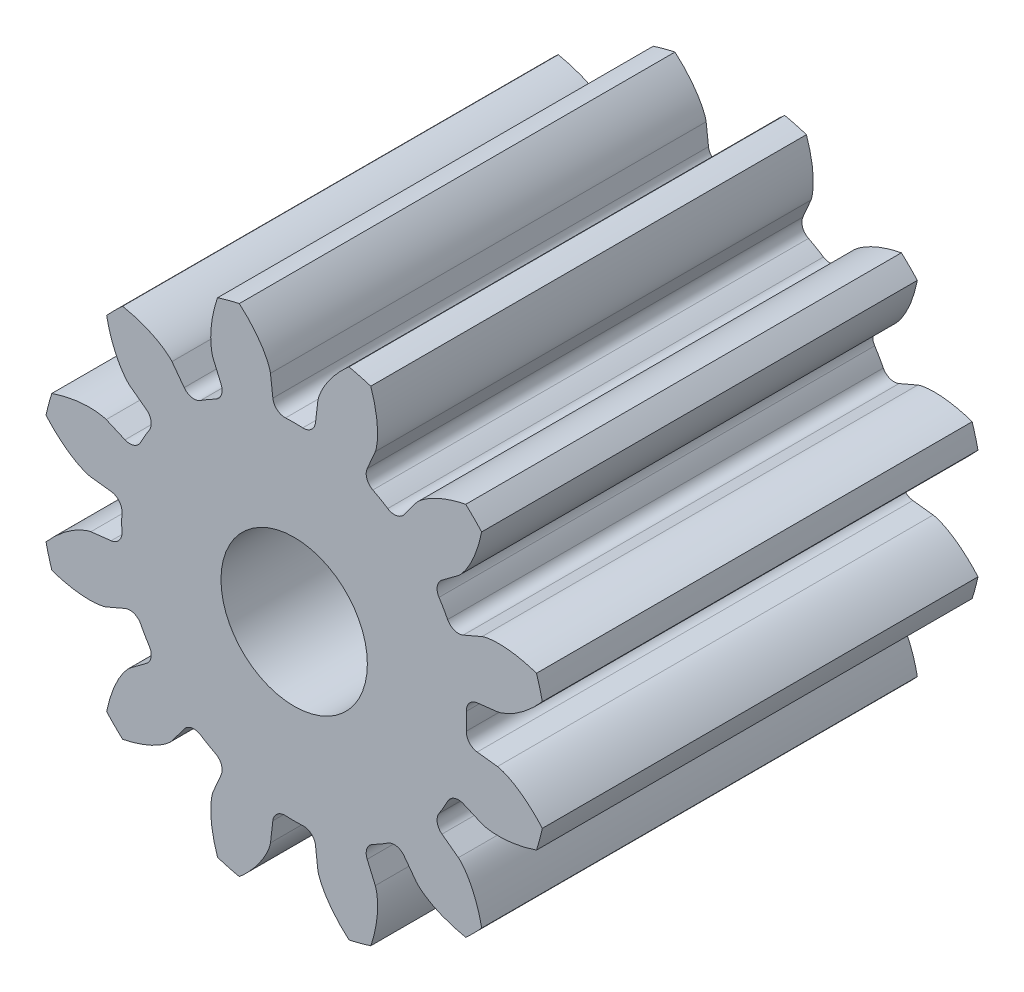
from build123d import *

# Parameters (mm, degrees)
BOSS_EXTRUDE1_DEPTH      = 6.35
BOSS_EXTRUDE1_DEPTH_BACK = 6.35
SKETCH3_R                = 7.408333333
SKETCH5_W                = 6.35
SKETCH5_H                = 2.582333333
SKETCH5_W_2              = 12.7
SKETCH5_H_2              = 2.38125
CUT_EXTRUDE1_DEPTH       = 13.251094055
FILLET1_R                = 0.355076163
CIRPATTERN1_COUNT        = 12
FILLET1_OF_CIRPATTERN1_R = 0.355076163
SKETCH6_R                = 9.160380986
CUT_EXTRUDE2_DEPTH       = 6.35
SCALE1_SCALE             = 1.5
SKETCH14_R               = 3.571875
BOSS_EXTRUDE7_DEPTH      = 9.525
SKETCH16_R               = 5.977624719
SKETCH16_R_2             = 3.2004
BOSS_EXTRUDE8_DEPTH      = 19.05


with BuildPart() as part:
    # Sketch3 → Boss-Extrude1 (new, two sides: drawn at the far end of the back side and taken through both)
    with BuildSketch(Plane.XY.offset(-BOSS_EXTRUDE1_DEPTH_BACK)):
        Circle(SKETCH3_R)
    extrude(amount=BOSS_EXTRUDE1_DEPTH + BOSS_EXTRUDE1_DEPTH_BACK)

    # Sketch5 → Cut-Revolve1 (revolve, cut)
    with BuildSketch(Plane(origin=(0, 0, 0), x_dir=(0, 0, -1), z_dir=(1, 0, 0)), mode=Mode.PRIVATE) as cut_revolve1_sk:
        with Locations((-3.175, 6.117166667)):
            Rectangle(SKETCH5_W, SKETCH5_H)
        with Locations((0, 1.190625)):
            Rectangle(SKETCH5_W_2, SKETCH5_H_2)
    revolve(cut_revolve1_sk.sketch.rotate(Axis((0, 0, 6.35), (0, 0, -1)), 90), axis=Axis((0, 0, 6.35), (0, 0, -1)), mode=Mode.SUBTRACT)

    # Sketch4 → Cut-Extrude1 (cut, symmetric)
    with BuildSketch(Plane.XY):
        with BuildLine():
            Line((4.993301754, 0.581811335), (5.926950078, 0.690598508))
            add(Edge.make_bspline(
                [(5.926950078, 0.690598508), (5.929318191, 0.690911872), (5.935944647, 0.691904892), (5.948407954, 0.694232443), (5.96863478, 0.69866684), (5.994230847, 0.70524939), (6.027084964, 0.714822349), (6.065467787, 0.727462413), (6.107282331, 0.74277265), (6.152345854, 0.760950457), (6.196898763, 0.780422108), (6.240942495, 0.801081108), (6.284441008, 0.822769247), (6.336662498, 0.8503395), (6.398612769, 0.885198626), (6.469984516, 0.92853373), (6.54965538, 0.980716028), (6.629400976, 1.037091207), (6.706647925, 1.095172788), (6.78320647, 1.156800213), (6.856219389, 1.218511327), (6.930432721, 1.285554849), (6.998115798, 1.348944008), (7.07205666, 1.423150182), (7.131183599, 1.483972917), (7.190627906, 1.549410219), (7.219315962, 1.581641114), (7.233873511, 1.598273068)],
                knots=[0, 0, 0, 0, 0, 0.005376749, 0.015083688, 0.02853182, 0.046610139, 0.064854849, 0.092110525, 0.119476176, 0.146842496, 0.174208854, 0.201574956, 0.228941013, 0.256307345, 0.307035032, 0.361767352, 0.416499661, 0.471231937, 0.525964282, 0.580696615, 0.635428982, 0.690161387, 0.744893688, 0.799626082, 0.854358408, 0.909090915, 0.909090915, 0.909090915, 0.909090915, 0.909090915], degree=4))
            ThreePointArc((7.233873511, 1.598273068), (7.408333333, 0), (7.233873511, -1.598273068))
            add(Edge.make_bspline(
                [(5.926950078, -0.690598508), (5.929318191, -0.690911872), (5.935944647, -0.691904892), (5.948407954, -0.694232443), (5.96863478, -0.69866684), (5.994230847, -0.70524939), (6.027084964, -0.714822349), (6.065467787, -0.727462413), (6.107282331, -0.74277265), (6.152345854, -0.760950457), (6.196898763, -0.780422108), (6.240942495, -0.801081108), (6.284441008, -0.822769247), (6.336662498, -0.8503395), (6.398612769, -0.885198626), (6.469984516, -0.92853373), (6.54965538, -0.980716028), (6.629400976, -1.037091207), (6.706647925, -1.095172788), (6.78320647, -1.156800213), (6.856219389, -1.218511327), (6.930432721, -1.285554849), (6.998115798, -1.348944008), (7.07205666, -1.423150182), (7.131183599, -1.483972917), (7.190627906, -1.549410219), (7.219315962, -1.581641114), (7.233873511, -1.598273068)],
                knots=[0, 0, 0, 0, 0, 0.005376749, 0.015083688, 0.02853182, 0.046610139, 0.064854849, 0.092110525, 0.119476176, 0.146842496, 0.174208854, 0.201574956, 0.228941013, 0.256307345, 0.307035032, 0.361767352, 0.416499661, 0.471231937, 0.525964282, 0.580696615, 0.635428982, 0.690161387, 0.744893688, 0.799626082, 0.854358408, 0.909090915, 0.909090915, 0.909090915, 0.909090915, 0.909090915], degree=4))
            Line((5.926950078, -0.690598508), (4.993301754, -0.581811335))
            ThreePointArc((4.993301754, -0.581811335), (5.027083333, 0), (4.993301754, 0.581811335))
        make_face()
    cut_extrude1 = extrude(amount=CUT_EXTRUDE1_DEPTH, both=True, mode=Mode.SUBTRACT)

    # Fillet1
    fillet1_edges = [part.edges().sort_by_distance(p)[0] for p in [
        (4.993301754, -0.581811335, -3.175),
        (4.993301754, 0.581811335, -3.175),
    ]]
    fillet(fillet1_edges, radius=FILLET1_R)

    # CirPattern1: Cut-Extrude1 ×12 about axis
    cirpattern1_axis = Axis((0, 0, 6.35), (0, 0, -1))
    for i in range(1, CIRPATTERN1_COUNT):
        add(cut_extrude1.rotate(cirpattern1_axis, i * 360 / CIRPATTERN1_COUNT), mode=Mode.SUBTRACT)

    # Fillet1 of CirPattern1
    fillet1_of_cirpattern1_edges = [part.edges().sort_by_distance(p)[0] for p in [
        (4.0334205, -3.000514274, -3.175),
        (4.615231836, -1.99278748, -3.175),
        (1.99278748, -4.615231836, -3.175),
        (3.000514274, -4.0334205, -3.175),
        (-0.581811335, -4.993301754, -3.175),
        (0.581811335, -4.993301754, -3.175),
        (-3.000514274, -4.0334205, -3.175),
        (-1.99278748, -4.615231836, -3.175),
        (-4.615231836, -1.99278748, -3.175),
        (-4.0334205, -3.000514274, -3.175),
        (-4.993301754, 0.581811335, -3.175),
        (-4.993301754, -0.581811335, -3.175),
        (-4.0334205, 3.000514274, -3.175),
        (-4.615231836, 1.99278748, -3.175),
        (-1.99278748, 4.615231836, -3.175),
        (-3.000514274, 4.0334205, -3.175),
        (0.581811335, 4.993301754, -3.175),
        (-0.581811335, 4.993301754, -3.175),
        (3.000514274, 4.0334205, -3.175),
        (1.99278748, 4.615231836, -3.175),
        (4.615231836, 1.99278748, -3.175),
        (4.0334205, 3.000514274, -3.175),
    ]]
    fillet(fillet1_of_cirpattern1_edges, radius=FILLET1_OF_CIRPATTERN1_R)

    # Sketch6 → Cut-Extrude2 (cut)
    with BuildSketch(Plane.XY.offset(6.35)):
        Circle(SKETCH6_R)
    extrude(amount=-CUT_EXTRUDE2_DEPTH, mode=Mode.SUBTRACT)


with BuildPart() as part_1:
    # Scale1: scaled about (-1e-08, 0, -3.174999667)
    add(part.part.scale(SCALE1_SCALE).moved(Location((5e-09, 0, 1.587499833))))


with BuildPart() as boss_extrude7_tool:
    # Sketch14 → Boss-Extrude7 (new body)
    with BuildSketch(Plane(origin=(0, 0, -7.937501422), x_dir=(-1, 0, 0), z_dir=(0, 0, -1))):
        with BuildLine():
            Line((-5.342326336, -7.181385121), (-4.808174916, -6.46335578))
            ThreePointArc((-4.808174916, -6.46335578), (-4.475570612, -6.2571353), (-4.091822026, -6.333878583))
            ThreePointArc((-4.091822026, -6.333878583), (-3.7703125, -6.53037281), (-3.439388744, -6.710561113))
            ThreePointArc((-3.439388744, -6.710561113), (-3.181052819, -7.004525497), (-3.193342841, -7.395679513))
            Line((-3.193342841, -7.395679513), (-3.548098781, -8.217282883))
            add(Edge.make_bspline(
                [(-3.548098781, -8.217282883), (-3.549467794, -8.220594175), (-3.553147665, -8.229946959), (-3.559471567, -8.247882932), (-3.568881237, -8.277484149), (-3.579527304, -8.315671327), (-3.591732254, -8.365529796), (-3.604099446, -8.424870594), (-3.615571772, -8.490671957), (-3.62575575, -8.562844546), (-3.633876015, -8.635324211), (-3.640071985, -8.708032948), (-3.644522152, -8.780805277), (-3.64787346, -8.869320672), (-3.649052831, -8.97594078), (-3.64628769, -9.101156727), (-3.638254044, -9.243788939), (-3.624829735, -9.38966289), (-3.60731476, -9.533570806), (-3.584677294, -9.679243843), (-3.559271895, -9.820373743), (-3.527839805, -9.96706233), (-3.496257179, -10.102527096), (-3.455316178, -10.254233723), (-3.420650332, -10.376658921), (-3.380228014, -10.502957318), (-3.359874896, -10.564397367), (-3.349187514, -10.595782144)],
                knots=[0, 0, 0, 0, 0, 0.005376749, 0.015083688, 0.02853182, 0.046610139, 0.064854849, 0.092110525, 0.119476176, 0.146842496, 0.174208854, 0.201574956, 0.228941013, 0.256307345, 0.307035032, 0.361767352, 0.416499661, 0.471231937, 0.525964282, 0.580696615, 0.635428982, 0.690161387, 0.744893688, 0.799626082, 0.854358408, 0.909090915, 0.909090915, 0.909090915, 0.909090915, 0.909090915], degree=4))
            ThreePointArc((-3.349187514, -10.595782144), (-2.876126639, -10.733850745), (-2.397409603, -10.850810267))
            add(Edge.make_bspline(
                [(-2.397409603, -10.850810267), (-2.37246167, -10.828973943), (-2.324115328, -10.785941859), (-2.225959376, -10.696775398), (-2.134725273, -10.608084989), (-2.023416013, -10.497173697), (-1.928332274, -10.395649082), (-1.827766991, -10.284329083), (-1.73520032, -10.174809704), (-1.642759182, -10.059971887), (-1.555636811, -9.944101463), (-1.471074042, -9.824483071), (-1.392800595, -9.704976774), (-1.327797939, -9.597919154), (-1.27550925, -9.504993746), (-1.23415387, -9.426661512), (-1.201621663, -9.361413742), (-1.170633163, -9.295348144), (-1.141425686, -9.22851878), (-1.114158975, -9.160923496), (-1.091193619, -9.098201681), (-1.072233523, -9.040627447), (-1.057874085, -8.991346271), (-1.04800026, -8.952952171), (-1.041348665, -8.92261193), (-1.037857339, -8.903916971), (-1.036367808, -8.893977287), (-1.035897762, -8.890425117)],
                knots=[0, 0, 0, 0, 0, 0.054732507, 0.109464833, 0.164197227, 0.218929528, 0.273661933, 0.328394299, 0.383126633, 0.437858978, 0.492591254, 0.547323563, 0.602055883, 0.65278357, 0.680149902, 0.707515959, 0.734882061, 0.762248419, 0.789614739, 0.81698039, 0.844236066, 0.862480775, 0.880559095, 0.894007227, 0.903714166, 0.909090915, 0.909090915, 0.909090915, 0.909090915, 0.909090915], degree=4))
            Line((-1.035897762, -8.890425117), (-0.932323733, -8.001517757))
            ThreePointArc((-0.932323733, -8.001517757), (-0.747390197, -7.656623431), (-0.376682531, -7.53121077))
            ThreePointArc((-0.376682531, -7.53121077), (0, -7.540625), (0.376682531, -7.53121077))
            ThreePointArc((0.376682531, -7.53121077), (0.747390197, -7.656623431), (0.932323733, -8.001517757))
            Line((0.932323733, -8.001517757), (1.035897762, -8.890425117))
            add(Edge.make_bspline(
                [(1.035897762, -8.890425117), (1.036367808, -8.893977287), (1.037857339, -8.903916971), (1.041348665, -8.92261193), (1.04800026, -8.952952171), (1.057874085, -8.991346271), (1.072233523, -9.040627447), (1.091193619, -9.098201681), (1.114158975, -9.160923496), (1.141425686, -9.22851878), (1.170633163, -9.295348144), (1.201621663, -9.361413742), (1.23415387, -9.426661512), (1.27550925, -9.504993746), (1.327797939, -9.597919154), (1.392800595, -9.704976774), (1.471074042, -9.824483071), (1.555636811, -9.944101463), (1.642759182, -10.059971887), (1.73520032, -10.174809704), (1.827766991, -10.284329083), (1.928332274, -10.395649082), (2.023416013, -10.497173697), (2.134725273, -10.608084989), (2.225959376, -10.696775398), (2.324115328, -10.785941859), (2.37246167, -10.828973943), (2.397409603, -10.850810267)],
                knots=[0, 0, 0, 0, 0, 0.005376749, 0.015083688, 0.02853182, 0.046610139, 0.064854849, 0.092110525, 0.119476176, 0.146842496, 0.174208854, 0.201574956, 0.228941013, 0.256307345, 0.307035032, 0.361767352, 0.416499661, 0.471231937, 0.525964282, 0.580696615, 0.635428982, 0.690161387, 0.744893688, 0.799626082, 0.854358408, 0.909090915, 0.909090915, 0.909090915, 0.909090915, 0.909090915], degree=4))
            ThreePointArc((2.397409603, -10.850810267), (2.876126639, -10.733850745), (3.349187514, -10.595782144))
            add(Edge.make_bspline(
                [(3.349187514, -10.595782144), (3.359874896, -10.564397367), (3.380228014, -10.502957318), (3.420650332, -10.376658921), (3.455316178, -10.254233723), (3.496257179, -10.102527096), (3.527839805, -9.96706233), (3.559271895, -9.820373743), (3.584677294, -9.679243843), (3.60731476, -9.533570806), (3.624829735, -9.38966289), (3.638254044, -9.243788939), (3.64628769, -9.101156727), (3.649052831, -8.97594078), (3.64787346, -8.869320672), (3.644522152, -8.780805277), (3.640071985, -8.708032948), (3.633876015, -8.635324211), (3.62575575, -8.562844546), (3.615571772, -8.490671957), (3.604099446, -8.424870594), (3.591732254, -8.365529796), (3.579527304, -8.315671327), (3.568881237, -8.277484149), (3.559471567, -8.247882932), (3.553147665, -8.229946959), (3.549467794, -8.220594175), (3.548098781, -8.217282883)],
                knots=[0, 0, 0, 0, 0, 0.054732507, 0.109464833, 0.164197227, 0.218929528, 0.273661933, 0.328394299, 0.383126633, 0.437858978, 0.492591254, 0.547323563, 0.602055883, 0.65278357, 0.680149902, 0.707515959, 0.734882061, 0.762248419, 0.789614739, 0.81698039, 0.844236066, 0.862480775, 0.880559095, 0.894007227, 0.903714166, 0.909090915, 0.909090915, 0.909090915, 0.909090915, 0.909090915], degree=4))
            Line((3.548098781, -8.217282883), (3.193342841, -7.395679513))
            ThreePointArc((3.193342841, -7.395679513), (3.181052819, -7.004525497), (3.439388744, -6.710561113))
            ThreePointArc((3.439388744, -6.710561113), (3.7703125, -6.53037281), (4.091822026, -6.333878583))
            ThreePointArc((4.091822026, -6.333878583), (4.475570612, -6.2571353), (4.808174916, -6.46335578))
            Line((4.808174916, -6.46335578), (5.342326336, -7.181385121))
            add(Edge.make_bspline(
                [(5.342326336, -7.181385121), (5.344509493, -7.184226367), (5.350769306, -7.192089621), (5.363140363, -7.206534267), (5.384070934, -7.229483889), (5.411818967, -7.257797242), (5.448895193, -7.293296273), (5.494102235, -7.333676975), (5.545351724, -7.376512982), (5.602763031, -7.42141886), (5.661472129, -7.464691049), (5.721341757, -7.506411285), (5.782139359, -7.546651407), (5.857120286, -7.593811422), (5.948866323, -7.648142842), (6.058689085, -7.708356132), (6.186229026, -7.772714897), (6.319271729, -7.83402608), (6.452657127, -7.890811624), (6.59013241, -7.944043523), (6.725057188, -7.992606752), (6.867809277, -8.038730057), (7.000916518, -8.079111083), (7.152768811, -8.11950845), (7.276125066, -8.150699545), (7.405713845, -8.17884199), (7.469099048, -8.191935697), (7.501622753, -8.198372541)],
                knots=[0, 0, 0, 0, 0, 0.005376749, 0.015083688, 0.02853182, 0.046610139, 0.064854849, 0.092110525, 0.119476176, 0.146842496, 0.174208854, 0.201574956, 0.228941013, 0.256307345, 0.307035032, 0.361767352, 0.416499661, 0.471231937, 0.525964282, 0.580696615, 0.635428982, 0.690161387, 0.744893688, 0.799626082, 0.854358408, 0.909090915, 0.909090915, 0.909090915, 0.909090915, 0.909090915], degree=4))
            ThreePointArc((7.501622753, -8.198372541), (7.857724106, -7.857724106), (8.198372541, -7.501622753))
            add(Edge.make_bspline(
                [(8.198372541, -7.501622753), (8.191935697, -7.469099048), (8.17884199, -7.405713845), (8.150699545, -7.276125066), (8.11950845, -7.152768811), (8.079111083, -7.000916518), (8.038730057, -6.867809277), (7.992606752, -6.725057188), (7.944043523, -6.59013241), (7.890811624, -6.452657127), (7.83402608, -6.319271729), (7.772714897, -6.186229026), (7.708356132, -6.058689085), (7.648142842, -5.948866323), (7.593811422, -5.857120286), (7.546651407, -5.782139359), (7.506411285, -5.721341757), (7.464691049, -5.661472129), (7.42141886, -5.602763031), (7.376512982, -5.545351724), (7.333676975, -5.494102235), (7.293296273, -5.448895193), (7.257797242, -5.411818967), (7.229483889, -5.384070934), (7.206534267, -5.363140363), (7.192089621, -5.350769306), (7.184226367, -5.344509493), (7.181385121, -5.342326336)],
                knots=[0, 0, 0, 0, 0, 0.054732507, 0.109464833, 0.164197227, 0.218929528, 0.273661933, 0.328394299, 0.383126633, 0.437858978, 0.492591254, 0.547323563, 0.602055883, 0.65278357, 0.680149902, 0.707515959, 0.734882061, 0.762248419, 0.789614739, 0.81698039, 0.844236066, 0.862480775, 0.880559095, 0.894007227, 0.903714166, 0.909090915, 0.909090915, 0.909090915, 0.909090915, 0.909090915], degree=4))
            Line((7.181385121, -5.342326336), (6.46335578, -4.808174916))
            ThreePointArc((6.46335578, -4.808174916), (6.2571353, -4.475570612), (6.333878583, -4.091822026))
            ThreePointArc((6.333878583, -4.091822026), (6.53037281, -3.7703125), (6.710561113, -3.439388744))
            ThreePointArc((6.710561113, -3.439388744), (7.004525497, -3.181052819), (7.395679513, -3.193342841))
            Line((7.395679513, -3.193342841), (8.217282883, -3.548098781))
            add(Edge.make_bspline(
                [(8.217282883, -3.548098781), (8.220594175, -3.549467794), (8.229946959, -3.553147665), (8.247882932, -3.559471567), (8.277484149, -3.568881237), (8.315671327, -3.579527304), (8.365529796, -3.591732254), (8.424870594, -3.604099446), (8.490671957, -3.615571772), (8.562844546, -3.62575575), (8.635324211, -3.633876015), (8.708032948, -3.640071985), (8.780805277, -3.644522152), (8.869320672, -3.64787346), (8.97594078, -3.649052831), (9.101156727, -3.64628769), (9.243788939, -3.638254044), (9.38966289, -3.624829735), (9.533570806, -3.60731476), (9.679243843, -3.584677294), (9.820373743, -3.559271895), (9.96706233, -3.527839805), (10.102527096, -3.496257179), (10.254233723, -3.455316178), (10.376658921, -3.420650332), (10.502957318, -3.380228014), (10.564397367, -3.359874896), (10.595782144, -3.349187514)],
                knots=[0, 0, 0, 0, 0, 0.005376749, 0.015083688, 0.02853182, 0.046610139, 0.064854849, 0.092110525, 0.119476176, 0.146842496, 0.174208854, 0.201574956, 0.228941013, 0.256307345, 0.307035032, 0.361767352, 0.416499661, 0.471231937, 0.525964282, 0.580696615, 0.635428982, 0.690161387, 0.744893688, 0.799626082, 0.854358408, 0.909090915, 0.909090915, 0.909090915, 0.909090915, 0.909090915], degree=4))
            ThreePointArc((10.595782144, -3.349187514), (10.733850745, -2.876126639), (10.850810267, -2.397409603))
            add(Edge.make_bspline(
                [(10.850810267, -2.397409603), (10.828973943, -2.37246167), (10.785941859, -2.324115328), (10.696775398, -2.225959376), (10.608084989, -2.134725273), (10.497173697, -2.023416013), (10.395649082, -1.928332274), (10.284329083, -1.827766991), (10.174809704, -1.73520032), (10.059971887, -1.642759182), (9.944101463, -1.555636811), (9.824483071, -1.471074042), (9.704976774, -1.392800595), (9.597919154, -1.327797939), (9.504993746, -1.27550925), (9.426661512, -1.23415387), (9.361413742, -1.201621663), (9.295348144, -1.170633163), (9.22851878, -1.141425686), (9.160923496, -1.114158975), (9.098201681, -1.091193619), (9.040627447, -1.072233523), (8.991346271, -1.057874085), (8.952952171, -1.04800026), (8.92261193, -1.041348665), (8.903916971, -1.037857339), (8.893977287, -1.036367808), (8.890425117, -1.035897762)],
                knots=[0, 0, 0, 0, 0, 0.054732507, 0.109464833, 0.164197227, 0.218929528, 0.273661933, 0.328394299, 0.383126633, 0.437858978, 0.492591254, 0.547323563, 0.602055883, 0.65278357, 0.680149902, 0.707515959, 0.734882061, 0.762248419, 0.789614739, 0.81698039, 0.844236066, 0.862480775, 0.880559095, 0.894007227, 0.903714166, 0.909090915, 0.909090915, 0.909090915, 0.909090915, 0.909090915], degree=4))
            Line((8.890425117, -1.035897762), (8.001517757, -0.932323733))
            ThreePointArc((8.001517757, -0.932323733), (7.656623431, -0.747390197), (7.53121077, -0.376682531))
            ThreePointArc((7.53121077, -0.376682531), (7.540625, 0), (7.53121077, 0.376682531))
            ThreePointArc((7.53121077, 0.376682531), (7.656623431, 0.747390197), (8.001517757, 0.932323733))
            Line((8.001517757, 0.932323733), (8.890425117, 1.035897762))
            add(Edge.make_bspline(
                [(8.890425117, 1.035897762), (8.893977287, 1.036367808), (8.903916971, 1.037857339), (8.92261193, 1.041348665), (8.952952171, 1.04800026), (8.991346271, 1.057874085), (9.040627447, 1.072233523), (9.098201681, 1.091193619), (9.160923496, 1.114158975), (9.22851878, 1.141425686), (9.295348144, 1.170633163), (9.361413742, 1.201621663), (9.426661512, 1.23415387), (9.504993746, 1.27550925), (9.597919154, 1.327797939), (9.704976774, 1.392800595), (9.824483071, 1.471074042), (9.944101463, 1.555636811), (10.059971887, 1.642759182), (10.174809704, 1.73520032), (10.284329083, 1.827766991), (10.395649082, 1.928332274), (10.497173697, 2.023416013), (10.608084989, 2.134725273), (10.696775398, 2.225959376), (10.785941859, 2.324115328), (10.828973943, 2.37246167), (10.850810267, 2.397409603)],
                knots=[0, 0, 0, 0, 0, 0.005376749, 0.015083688, 0.02853182, 0.046610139, 0.064854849, 0.092110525, 0.119476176, 0.146842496, 0.174208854, 0.201574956, 0.228941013, 0.256307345, 0.307035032, 0.361767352, 0.416499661, 0.471231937, 0.525964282, 0.580696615, 0.635428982, 0.690161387, 0.744893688, 0.799626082, 0.854358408, 0.909090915, 0.909090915, 0.909090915, 0.909090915, 0.909090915], degree=4))
            ThreePointArc((10.850810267, 2.397409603), (10.733850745, 2.876126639), (10.595782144, 3.349187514))
            add(Edge.make_bspline(
                [(10.595782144, 3.349187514), (10.564397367, 3.359874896), (10.502957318, 3.380228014), (10.376658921, 3.420650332), (10.254233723, 3.455316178), (10.102527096, 3.496257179), (9.96706233, 3.527839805), (9.820373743, 3.559271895), (9.679243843, 3.584677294), (9.533570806, 3.60731476), (9.38966289, 3.624829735), (9.243788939, 3.638254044), (9.101156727, 3.64628769), (8.97594078, 3.649052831), (8.869320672, 3.64787346), (8.780805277, 3.644522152), (8.708032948, 3.640071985), (8.635324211, 3.633876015), (8.562844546, 3.62575575), (8.490671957, 3.615571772), (8.424870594, 3.604099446), (8.365529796, 3.591732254), (8.315671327, 3.579527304), (8.277484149, 3.568881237), (8.247882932, 3.559471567), (8.229946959, 3.553147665), (8.220594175, 3.549467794), (8.217282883, 3.548098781)],
                knots=[0, 0, 0, 0, 0, 0.054732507, 0.109464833, 0.164197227, 0.218929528, 0.273661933, 0.328394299, 0.383126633, 0.437858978, 0.492591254, 0.547323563, 0.602055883, 0.65278357, 0.680149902, 0.707515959, 0.734882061, 0.762248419, 0.789614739, 0.81698039, 0.844236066, 0.862480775, 0.880559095, 0.894007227, 0.903714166, 0.909090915, 0.909090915, 0.909090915, 0.909090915, 0.909090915], degree=4))
            Line((8.217282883, 3.548098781), (7.395679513, 3.193342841))
            ThreePointArc((7.395679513, 3.193342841), (7.004525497, 3.181052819), (6.710561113, 3.439388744))
            ThreePointArc((6.710561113, 3.439388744), (6.53037281, 3.7703125), (6.333878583, 4.091822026))
            ThreePointArc((6.333878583, 4.091822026), (6.2571353, 4.475570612), (6.46335578, 4.808174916))
            Line((6.46335578, 4.808174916), (7.181385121, 5.342326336))
            add(Edge.make_bspline(
                [(7.181385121, 5.342326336), (7.184226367, 5.344509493), (7.192089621, 5.350769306), (7.206534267, 5.363140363), (7.229483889, 5.384070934), (7.257797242, 5.411818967), (7.293296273, 5.448895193), (7.333676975, 5.494102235), (7.376512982, 5.545351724), (7.42141886, 5.602763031), (7.464691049, 5.661472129), (7.506411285, 5.721341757), (7.546651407, 5.782139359), (7.593811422, 5.857120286), (7.648142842, 5.948866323), (7.708356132, 6.058689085), (7.772714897, 6.186229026), (7.83402608, 6.319271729), (7.890811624, 6.452657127), (7.944043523, 6.59013241), (7.992606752, 6.725057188), (8.038730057, 6.867809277), (8.079111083, 7.000916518), (8.11950845, 7.152768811), (8.150699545, 7.276125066), (8.17884199, 7.405713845), (8.191935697, 7.469099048), (8.198372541, 7.501622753)],
                knots=[0, 0, 0, 0, 0, 0.005376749, 0.015083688, 0.02853182, 0.046610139, 0.064854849, 0.092110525, 0.119476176, 0.146842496, 0.174208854, 0.201574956, 0.228941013, 0.256307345, 0.307035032, 0.361767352, 0.416499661, 0.471231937, 0.525964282, 0.580696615, 0.635428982, 0.690161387, 0.744893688, 0.799626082, 0.854358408, 0.909090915, 0.909090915, 0.909090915, 0.909090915, 0.909090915], degree=4))
            ThreePointArc((8.198372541, 7.501622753), (7.857724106, 7.857724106), (7.501622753, 8.198372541))
            add(Edge.make_bspline(
                [(7.501622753, 8.198372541), (7.469099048, 8.191935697), (7.405713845, 8.17884199), (7.276125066, 8.150699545), (7.152768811, 8.11950845), (7.000916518, 8.079111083), (6.867809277, 8.038730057), (6.725057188, 7.992606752), (6.59013241, 7.944043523), (6.452657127, 7.890811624), (6.319271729, 7.83402608), (6.186229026, 7.772714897), (6.058689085, 7.708356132), (5.948866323, 7.648142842), (5.857120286, 7.593811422), (5.782139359, 7.546651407), (5.721341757, 7.506411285), (5.661472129, 7.464691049), (5.602763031, 7.42141886), (5.545351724, 7.376512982), (5.494102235, 7.333676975), (5.448895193, 7.293296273), (5.411818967, 7.257797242), (5.384070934, 7.229483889), (5.363140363, 7.206534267), (5.350769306, 7.192089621), (5.344509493, 7.184226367), (5.342326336, 7.181385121)],
                knots=[0, 0, 0, 0, 0, 0.054732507, 0.109464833, 0.164197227, 0.218929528, 0.273661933, 0.328394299, 0.383126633, 0.437858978, 0.492591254, 0.547323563, 0.602055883, 0.65278357, 0.680149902, 0.707515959, 0.734882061, 0.762248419, 0.789614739, 0.81698039, 0.844236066, 0.862480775, 0.880559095, 0.894007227, 0.903714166, 0.909090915, 0.909090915, 0.909090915, 0.909090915, 0.909090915], degree=4))
            Line((5.342326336, 7.181385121), (4.808174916, 6.46335578))
            ThreePointArc((4.808174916, 6.46335578), (4.475570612, 6.2571353), (4.091822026, 6.333878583))
            ThreePointArc((4.091822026, 6.333878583), (3.7703125, 6.53037281), (3.439388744, 6.710561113))
            ThreePointArc((3.439388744, 6.710561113), (3.181052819, 7.004525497), (3.193342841, 7.395679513))
            Line((3.193342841, 7.395679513), (3.548098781, 8.217282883))
            add(Edge.make_bspline(
                [(3.548098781, 8.217282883), (3.549467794, 8.220594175), (3.553147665, 8.229946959), (3.559471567, 8.247882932), (3.568881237, 8.277484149), (3.579527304, 8.315671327), (3.591732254, 8.365529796), (3.604099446, 8.424870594), (3.615571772, 8.490671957), (3.62575575, 8.562844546), (3.633876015, 8.635324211), (3.640071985, 8.708032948), (3.644522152, 8.780805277), (3.64787346, 8.869320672), (3.649052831, 8.97594078), (3.64628769, 9.101156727), (3.638254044, 9.243788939), (3.624829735, 9.38966289), (3.60731476, 9.533570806), (3.584677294, 9.679243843), (3.559271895, 9.820373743), (3.527839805, 9.96706233), (3.496257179, 10.102527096), (3.455316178, 10.254233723), (3.420650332, 10.376658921), (3.380228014, 10.502957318), (3.359874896, 10.564397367), (3.349187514, 10.595782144)],
                knots=[0, 0, 0, 0, 0, 0.005376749, 0.015083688, 0.02853182, 0.046610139, 0.064854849, 0.092110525, 0.119476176, 0.146842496, 0.174208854, 0.201574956, 0.228941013, 0.256307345, 0.307035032, 0.361767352, 0.416499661, 0.471231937, 0.525964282, 0.580696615, 0.635428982, 0.690161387, 0.744893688, 0.799626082, 0.854358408, 0.909090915, 0.909090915, 0.909090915, 0.909090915, 0.909090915], degree=4))
            ThreePointArc((3.349187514, 10.595782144), (2.876126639, 10.733850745), (2.397409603, 10.850810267))
            add(Edge.make_bspline(
                [(2.397409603, 10.850810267), (2.37246167, 10.828973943), (2.324115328, 10.785941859), (2.225959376, 10.696775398), (2.134725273, 10.608084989), (2.023416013, 10.497173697), (1.928332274, 10.395649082), (1.827766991, 10.284329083), (1.73520032, 10.174809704), (1.642759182, 10.059971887), (1.555636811, 9.944101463), (1.471074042, 9.824483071), (1.392800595, 9.704976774), (1.327797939, 9.597919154), (1.27550925, 9.504993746), (1.23415387, 9.426661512), (1.201621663, 9.361413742), (1.170633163, 9.295348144), (1.141425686, 9.22851878), (1.114158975, 9.160923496), (1.091193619, 9.098201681), (1.072233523, 9.040627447), (1.057874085, 8.991346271), (1.04800026, 8.952952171), (1.041348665, 8.92261193), (1.037857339, 8.903916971), (1.036367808, 8.893977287), (1.035897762, 8.890425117)],
                knots=[0, 0, 0, 0, 0, 0.054732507, 0.109464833, 0.164197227, 0.218929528, 0.273661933, 0.328394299, 0.383126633, 0.437858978, 0.492591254, 0.547323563, 0.602055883, 0.65278357, 0.680149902, 0.707515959, 0.734882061, 0.762248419, 0.789614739, 0.81698039, 0.844236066, 0.862480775, 0.880559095, 0.894007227, 0.903714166, 0.909090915, 0.909090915, 0.909090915, 0.909090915, 0.909090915], degree=4))
            Line((1.035897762, 8.890425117), (0.932323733, 8.001517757))
            ThreePointArc((0.932323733, 8.001517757), (0.747390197, 7.656623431), (0.376682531, 7.53121077))
            ThreePointArc((0.376682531, 7.53121077), (0, 7.540625), (-0.376682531, 7.53121077))
            ThreePointArc((-0.376682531, 7.53121077), (-0.747390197, 7.656623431), (-0.932323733, 8.001517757))
            Line((-0.932323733, 8.001517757), (-1.035897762, 8.890425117))
            add(Edge.make_bspline(
                [(-1.035897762, 8.890425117), (-1.036367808, 8.893977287), (-1.037857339, 8.903916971), (-1.041348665, 8.92261193), (-1.04800026, 8.952952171), (-1.057874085, 8.991346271), (-1.072233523, 9.040627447), (-1.091193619, 9.098201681), (-1.114158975, 9.160923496), (-1.141425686, 9.22851878), (-1.170633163, 9.295348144), (-1.201621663, 9.361413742), (-1.23415387, 9.426661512), (-1.27550925, 9.504993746), (-1.327797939, 9.597919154), (-1.392800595, 9.704976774), (-1.471074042, 9.824483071), (-1.555636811, 9.944101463), (-1.642759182, 10.059971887), (-1.73520032, 10.174809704), (-1.827766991, 10.284329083), (-1.928332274, 10.395649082), (-2.023416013, 10.497173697), (-2.134725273, 10.608084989), (-2.225959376, 10.696775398), (-2.324115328, 10.785941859), (-2.37246167, 10.828973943), (-2.397409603, 10.850810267)],
                knots=[0, 0, 0, 0, 0, 0.005376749, 0.015083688, 0.02853182, 0.046610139, 0.064854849, 0.092110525, 0.119476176, 0.146842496, 0.174208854, 0.201574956, 0.228941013, 0.256307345, 0.307035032, 0.361767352, 0.416499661, 0.471231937, 0.525964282, 0.580696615, 0.635428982, 0.690161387, 0.744893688, 0.799626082, 0.854358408, 0.909090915, 0.909090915, 0.909090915, 0.909090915, 0.909090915], degree=4))
            ThreePointArc((-2.397409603, 10.850810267), (-2.876126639, 10.733850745), (-3.349187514, 10.595782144))
            add(Edge.make_bspline(
                [(-3.349187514, 10.595782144), (-3.359874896, 10.564397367), (-3.380228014, 10.502957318), (-3.420650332, 10.376658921), (-3.455316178, 10.254233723), (-3.496257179, 10.102527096), (-3.527839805, 9.96706233), (-3.559271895, 9.820373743), (-3.584677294, 9.679243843), (-3.60731476, 9.533570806), (-3.624829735, 9.38966289), (-3.638254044, 9.243788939), (-3.64628769, 9.101156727), (-3.649052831, 8.97594078), (-3.64787346, 8.869320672), (-3.644522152, 8.780805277), (-3.640071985, 8.708032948), (-3.633876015, 8.635324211), (-3.62575575, 8.562844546), (-3.615571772, 8.490671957), (-3.604099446, 8.424870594), (-3.591732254, 8.365529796), (-3.579527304, 8.315671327), (-3.568881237, 8.277484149), (-3.559471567, 8.247882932), (-3.553147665, 8.229946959), (-3.549467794, 8.220594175), (-3.548098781, 8.217282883)],
                knots=[0, 0, 0, 0, 0, 0.054732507, 0.109464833, 0.164197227, 0.218929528, 0.273661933, 0.328394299, 0.383126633, 0.437858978, 0.492591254, 0.547323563, 0.602055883, 0.65278357, 0.680149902, 0.707515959, 0.734882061, 0.762248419, 0.789614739, 0.81698039, 0.844236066, 0.862480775, 0.880559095, 0.894007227, 0.903714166, 0.909090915, 0.909090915, 0.909090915, 0.909090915, 0.909090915], degree=4))
            Line((-3.548098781, 8.217282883), (-3.193342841, 7.395679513))
            ThreePointArc((-3.193342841, 7.395679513), (-3.181052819, 7.004525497), (-3.439388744, 6.710561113))
            ThreePointArc((-3.439388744, 6.710561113), (-3.7703125, 6.53037281), (-4.091822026, 6.333878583))
            ThreePointArc((-4.091822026, 6.333878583), (-4.475570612, 6.2571353), (-4.808174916, 6.46335578))
            Line((-4.808174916, 6.46335578), (-5.342326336, 7.181385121))
            add(Edge.make_bspline(
                [(-5.342326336, 7.181385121), (-5.344509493, 7.184226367), (-5.350769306, 7.192089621), (-5.363140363, 7.206534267), (-5.384070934, 7.229483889), (-5.411818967, 7.257797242), (-5.448895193, 7.293296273), (-5.494102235, 7.333676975), (-5.545351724, 7.376512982), (-5.602763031, 7.42141886), (-5.661472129, 7.464691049), (-5.721341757, 7.506411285), (-5.782139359, 7.546651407), (-5.857120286, 7.593811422), (-5.948866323, 7.648142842), (-6.058689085, 7.708356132), (-6.186229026, 7.772714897), (-6.319271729, 7.83402608), (-6.452657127, 7.890811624), (-6.59013241, 7.944043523), (-6.725057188, 7.992606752), (-6.867809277, 8.038730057), (-7.000916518, 8.079111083), (-7.152768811, 8.11950845), (-7.276125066, 8.150699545), (-7.405713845, 8.17884199), (-7.469099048, 8.191935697), (-7.501622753, 8.198372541)],
                knots=[0, 0, 0, 0, 0, 0.005376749, 0.015083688, 0.02853182, 0.046610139, 0.064854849, 0.092110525, 0.119476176, 0.146842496, 0.174208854, 0.201574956, 0.228941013, 0.256307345, 0.307035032, 0.361767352, 0.416499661, 0.471231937, 0.525964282, 0.580696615, 0.635428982, 0.690161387, 0.744893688, 0.799626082, 0.854358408, 0.909090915, 0.909090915, 0.909090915, 0.909090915, 0.909090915], degree=4))
            ThreePointArc((-7.501622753, 8.198372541), (-7.857724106, 7.857724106), (-8.198372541, 7.501622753))
            add(Edge.make_bspline(
                [(-8.198372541, 7.501622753), (-8.191935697, 7.469099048), (-8.17884199, 7.405713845), (-8.150699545, 7.276125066), (-8.11950845, 7.152768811), (-8.079111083, 7.000916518), (-8.038730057, 6.867809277), (-7.992606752, 6.725057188), (-7.944043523, 6.59013241), (-7.890811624, 6.452657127), (-7.83402608, 6.319271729), (-7.772714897, 6.186229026), (-7.708356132, 6.058689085), (-7.648142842, 5.948866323), (-7.593811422, 5.857120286), (-7.546651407, 5.782139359), (-7.506411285, 5.721341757), (-7.464691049, 5.661472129), (-7.42141886, 5.602763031), (-7.376512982, 5.545351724), (-7.333676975, 5.494102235), (-7.293296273, 5.448895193), (-7.257797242, 5.411818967), (-7.229483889, 5.384070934), (-7.206534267, 5.363140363), (-7.192089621, 5.350769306), (-7.184226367, 5.344509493), (-7.181385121, 5.342326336)],
                knots=[0, 0, 0, 0, 0, 0.054732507, 0.109464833, 0.164197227, 0.218929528, 0.273661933, 0.328394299, 0.383126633, 0.437858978, 0.492591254, 0.547323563, 0.602055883, 0.65278357, 0.680149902, 0.707515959, 0.734882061, 0.762248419, 0.789614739, 0.81698039, 0.844236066, 0.862480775, 0.880559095, 0.894007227, 0.903714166, 0.909090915, 0.909090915, 0.909090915, 0.909090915, 0.909090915], degree=4))
            Line((-7.181385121, 5.342326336), (-6.46335578, 4.808174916))
            ThreePointArc((-6.46335578, 4.808174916), (-6.2571353, 4.475570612), (-6.333878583, 4.091822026))
            ThreePointArc((-6.333878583, 4.091822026), (-6.53037281, 3.7703125), (-6.710561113, 3.439388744))
            ThreePointArc((-6.710561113, 3.439388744), (-7.004525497, 3.181052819), (-7.395679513, 3.193342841))
            Line((-7.395679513, 3.193342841), (-8.217282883, 3.548098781))
            add(Edge.make_bspline(
                [(-8.217282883, 3.548098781), (-8.220594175, 3.549467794), (-8.229946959, 3.553147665), (-8.247882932, 3.559471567), (-8.277484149, 3.568881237), (-8.315671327, 3.579527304), (-8.365529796, 3.591732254), (-8.424870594, 3.604099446), (-8.490671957, 3.615571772), (-8.562844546, 3.62575575), (-8.635324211, 3.633876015), (-8.708032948, 3.640071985), (-8.780805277, 3.644522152), (-8.869320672, 3.64787346), (-8.97594078, 3.649052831), (-9.101156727, 3.64628769), (-9.243788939, 3.638254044), (-9.38966289, 3.624829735), (-9.533570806, 3.60731476), (-9.679243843, 3.584677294), (-9.820373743, 3.559271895), (-9.96706233, 3.527839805), (-10.102527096, 3.496257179), (-10.254233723, 3.455316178), (-10.376658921, 3.420650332), (-10.502957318, 3.380228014), (-10.564397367, 3.359874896), (-10.595782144, 3.349187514)],
                knots=[0, 0, 0, 0, 0, 0.005376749, 0.015083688, 0.02853182, 0.046610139, 0.064854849, 0.092110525, 0.119476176, 0.146842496, 0.174208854, 0.201574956, 0.228941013, 0.256307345, 0.307035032, 0.361767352, 0.416499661, 0.471231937, 0.525964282, 0.580696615, 0.635428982, 0.690161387, 0.744893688, 0.799626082, 0.854358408, 0.909090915, 0.909090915, 0.909090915, 0.909090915, 0.909090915], degree=4))
            ThreePointArc((-10.595782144, 3.349187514), (-10.733850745, 2.876126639), (-10.850810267, 2.397409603))
            add(Edge.make_bspline(
                [(-10.850810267, 2.397409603), (-10.828973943, 2.37246167), (-10.785941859, 2.324115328), (-10.696775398, 2.225959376), (-10.608084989, 2.134725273), (-10.497173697, 2.023416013), (-10.395649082, 1.928332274), (-10.284329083, 1.827766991), (-10.174809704, 1.73520032), (-10.059971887, 1.642759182), (-9.944101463, 1.555636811), (-9.824483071, 1.471074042), (-9.704976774, 1.392800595), (-9.597919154, 1.327797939), (-9.504993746, 1.27550925), (-9.426661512, 1.23415387), (-9.361413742, 1.201621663), (-9.295348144, 1.170633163), (-9.22851878, 1.141425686), (-9.160923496, 1.114158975), (-9.098201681, 1.091193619), (-9.040627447, 1.072233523), (-8.991346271, 1.057874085), (-8.952952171, 1.04800026), (-8.92261193, 1.041348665), (-8.903916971, 1.037857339), (-8.893977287, 1.036367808), (-8.890425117, 1.035897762)],
                knots=[0, 0, 0, 0, 0, 0.054732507, 0.109464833, 0.164197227, 0.218929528, 0.273661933, 0.328394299, 0.383126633, 0.437858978, 0.492591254, 0.547323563, 0.602055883, 0.65278357, 0.680149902, 0.707515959, 0.734882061, 0.762248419, 0.789614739, 0.81698039, 0.844236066, 0.862480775, 0.880559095, 0.894007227, 0.903714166, 0.909090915, 0.909090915, 0.909090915, 0.909090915, 0.909090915], degree=4))
            Line((-8.890425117, 1.035897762), (-8.001517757, 0.932323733))
            ThreePointArc((-8.001517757, 0.932323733), (-7.656623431, 0.747390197), (-7.53121077, 0.376682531))
            ThreePointArc((-7.53121077, 0.376682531), (-7.540625, 0), (-7.53121077, -0.376682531))
            ThreePointArc((-7.53121077, -0.376682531), (-7.656623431, -0.747390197), (-8.001517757, -0.932323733))
            Line((-8.001517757, -0.932323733), (-8.890425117, -1.035897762))
            add(Edge.make_bspline(
                [(-8.890425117, -1.035897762), (-8.893977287, -1.036367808), (-8.903916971, -1.037857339), (-8.92261193, -1.041348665), (-8.952952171, -1.04800026), (-8.991346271, -1.057874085), (-9.040627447, -1.072233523), (-9.098201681, -1.091193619), (-9.160923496, -1.114158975), (-9.22851878, -1.141425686), (-9.295348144, -1.170633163), (-9.361413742, -1.201621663), (-9.426661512, -1.23415387), (-9.504993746, -1.27550925), (-9.597919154, -1.327797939), (-9.704976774, -1.392800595), (-9.824483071, -1.471074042), (-9.944101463, -1.555636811), (-10.059971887, -1.642759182), (-10.174809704, -1.73520032), (-10.284329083, -1.827766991), (-10.395649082, -1.928332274), (-10.497173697, -2.023416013), (-10.608084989, -2.134725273), (-10.696775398, -2.225959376), (-10.785941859, -2.324115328), (-10.828973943, -2.37246167), (-10.850810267, -2.397409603)],
                knots=[0, 0, 0, 0, 0, 0.005376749, 0.015083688, 0.02853182, 0.046610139, 0.064854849, 0.092110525, 0.119476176, 0.146842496, 0.174208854, 0.201574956, 0.228941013, 0.256307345, 0.307035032, 0.361767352, 0.416499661, 0.471231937, 0.525964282, 0.580696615, 0.635428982, 0.690161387, 0.744893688, 0.799626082, 0.854358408, 0.909090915, 0.909090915, 0.909090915, 0.909090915, 0.909090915], degree=4))
            ThreePointArc((-10.850810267, -2.397409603), (-10.733850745, -2.876126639), (-10.595782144, -3.349187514))
            add(Edge.make_bspline(
                [(-10.595782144, -3.349187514), (-10.564397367, -3.359874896), (-10.502957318, -3.380228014), (-10.376658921, -3.420650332), (-10.254233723, -3.455316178), (-10.102527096, -3.496257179), (-9.96706233, -3.527839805), (-9.820373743, -3.559271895), (-9.679243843, -3.584677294), (-9.533570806, -3.60731476), (-9.38966289, -3.624829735), (-9.243788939, -3.638254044), (-9.101156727, -3.64628769), (-8.97594078, -3.649052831), (-8.869320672, -3.64787346), (-8.780805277, -3.644522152), (-8.708032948, -3.640071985), (-8.635324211, -3.633876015), (-8.562844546, -3.62575575), (-8.490671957, -3.615571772), (-8.424870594, -3.604099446), (-8.365529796, -3.591732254), (-8.315671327, -3.579527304), (-8.277484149, -3.568881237), (-8.247882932, -3.559471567), (-8.229946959, -3.553147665), (-8.220594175, -3.549467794), (-8.217282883, -3.548098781)],
                knots=[0, 0, 0, 0, 0, 0.054732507, 0.109464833, 0.164197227, 0.218929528, 0.273661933, 0.328394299, 0.383126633, 0.437858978, 0.492591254, 0.547323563, 0.602055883, 0.65278357, 0.680149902, 0.707515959, 0.734882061, 0.762248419, 0.789614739, 0.81698039, 0.844236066, 0.862480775, 0.880559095, 0.894007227, 0.903714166, 0.909090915, 0.909090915, 0.909090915, 0.909090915, 0.909090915], degree=4))
            Line((-8.217282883, -3.548098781), (-7.395679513, -3.193342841))
            ThreePointArc((-7.395679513, -3.193342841), (-7.004525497, -3.181052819), (-6.710561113, -3.439388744))
            ThreePointArc((-6.710561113, -3.439388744), (-6.53037281, -3.7703125), (-6.333878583, -4.091822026))
            ThreePointArc((-6.333878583, -4.091822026), (-6.2571353, -4.475570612), (-6.46335578, -4.808174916))
            Line((-6.46335578, -4.808174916), (-7.181385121, -5.342326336))
            add(Edge.make_bspline(
                [(-7.181385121, -5.342326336), (-7.184226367, -5.344509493), (-7.192089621, -5.350769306), (-7.206534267, -5.363140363), (-7.229483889, -5.384070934), (-7.257797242, -5.411818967), (-7.293296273, -5.448895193), (-7.333676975, -5.494102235), (-7.376512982, -5.545351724), (-7.42141886, -5.602763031), (-7.464691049, -5.661472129), (-7.506411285, -5.721341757), (-7.546651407, -5.782139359), (-7.593811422, -5.857120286), (-7.648142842, -5.948866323), (-7.708356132, -6.058689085), (-7.772714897, -6.186229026), (-7.83402608, -6.319271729), (-7.890811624, -6.452657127), (-7.944043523, -6.59013241), (-7.992606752, -6.725057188), (-8.038730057, -6.867809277), (-8.079111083, -7.000916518), (-8.11950845, -7.152768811), (-8.150699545, -7.276125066), (-8.17884199, -7.405713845), (-8.191935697, -7.469099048), (-8.198372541, -7.501622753)],
                knots=[0, 0, 0, 0, 0, 0.005376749, 0.015083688, 0.02853182, 0.046610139, 0.064854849, 0.092110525, 0.119476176, 0.146842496, 0.174208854, 0.201574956, 0.228941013, 0.256307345, 0.307035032, 0.361767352, 0.416499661, 0.471231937, 0.525964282, 0.580696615, 0.635428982, 0.690161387, 0.744893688, 0.799626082, 0.854358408, 0.909090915, 0.909090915, 0.909090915, 0.909090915, 0.909090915], degree=4))
            ThreePointArc((-8.198372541, -7.501622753), (-7.857724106, -7.857724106), (-7.501622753, -8.198372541))
            add(Edge.make_bspline(
                [(-7.501622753, -8.198372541), (-7.469099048, -8.191935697), (-7.405713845, -8.17884199), (-7.276125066, -8.150699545), (-7.152768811, -8.11950845), (-7.000916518, -8.079111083), (-6.867809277, -8.038730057), (-6.725057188, -7.992606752), (-6.59013241, -7.944043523), (-6.452657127, -7.890811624), (-6.319271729, -7.83402608), (-6.186229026, -7.772714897), (-6.058689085, -7.708356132), (-5.948866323, -7.648142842), (-5.857120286, -7.593811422), (-5.782139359, -7.546651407), (-5.721341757, -7.506411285), (-5.661472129, -7.464691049), (-5.602763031, -7.42141886), (-5.545351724, -7.376512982), (-5.494102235, -7.333676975), (-5.448895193, -7.293296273), (-5.411818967, -7.257797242), (-5.384070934, -7.229483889), (-5.363140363, -7.206534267), (-5.350769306, -7.192089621), (-5.344509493, -7.184226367), (-5.342326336, -7.181385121)],
                knots=[0, 0, 0, 0, 0, 0.054732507, 0.109464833, 0.164197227, 0.218929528, 0.273661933, 0.328394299, 0.383126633, 0.437858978, 0.492591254, 0.547323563, 0.602055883, 0.65278357, 0.680149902, 0.707515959, 0.734882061, 0.762248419, 0.789614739, 0.81698039, 0.844236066, 0.862480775, 0.880559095, 0.894007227, 0.903714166, 0.909090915, 0.909090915, 0.909090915, 0.909090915, 0.909090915], degree=4))
        make_face()
        with Locations(Location((0, 0, 0), (0, 0, 180))):
            Circle(SKETCH14_R, mode=Mode.SUBTRACT)
    extrude(amount=BOSS_EXTRUDE7_DEPTH)


with BuildPart() as part_2:
    add(part_1.part)


with BuildPart() as part_3:
    # Boss-Extrude7: joined with boss_extrude7_tool
    add(part_2.part.fuse(boss_extrude7_tool.part, tol=0.00001))

    # Sketch16 → Boss-Extrude8 (add)
    with BuildSketch(Plane(origin=(0, 0, -17.462501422), x_dir=(-1, 0, 0), z_dir=(0, 0, -1))):
        Circle(SKETCH16_R)
        Circle(SKETCH16_R_2, mode=Mode.SUBTRACT)
    extrude(amount=-BOSS_EXTRUDE8_DEPTH)


solid = part_3.part
